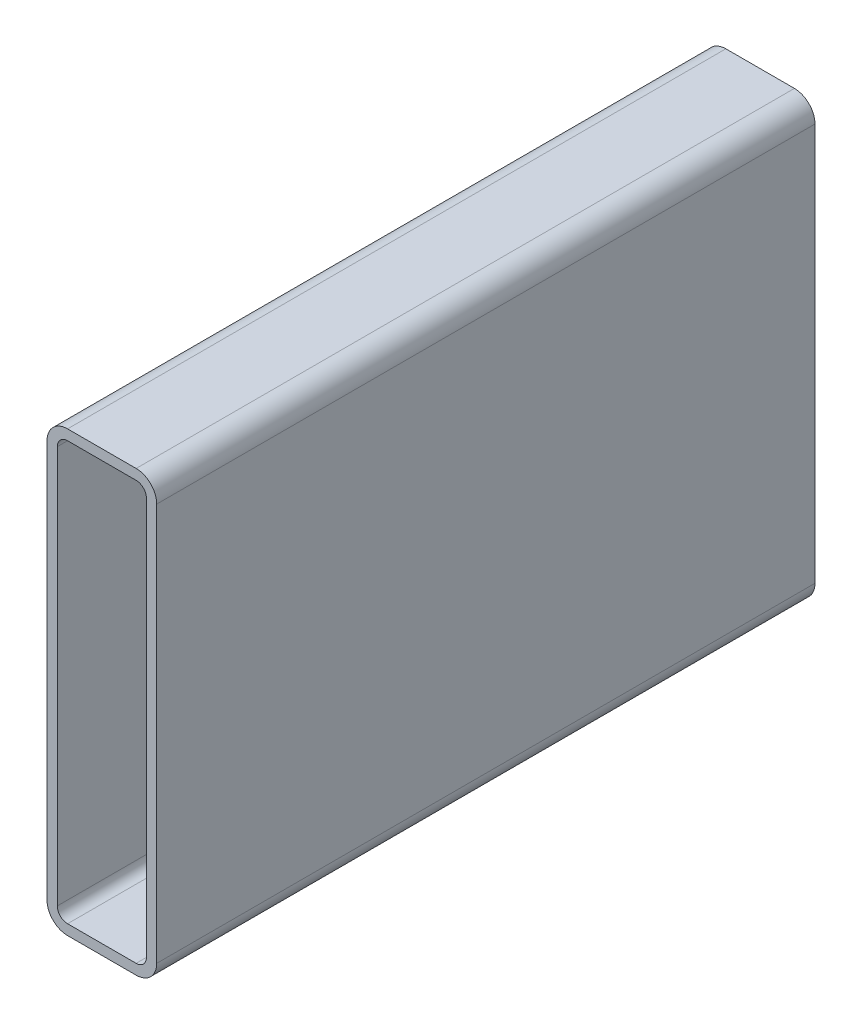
ISO-10303-21;
HEADER;
FILE_DESCRIPTION(('STEP AP214'),'2;1');
FILE_NAME('part.step','',(''),(''),'','','');
FILE_SCHEMA(('AUTOMOTIVE_DESIGN { 1 0 10303 214 1 1 1 1 }'));
ENDSEC;
DATA;
#1=APPLICATION_CONTEXT('core data for automotive mechanical design processes');
#2=APPLICATION_PROTOCOL_DEFINITION('international standard','automotive_design',2000,#1);
#3=PRODUCT_CONTEXT('',#1,'mechanical');
#4=PRODUCT('Part','Part','',(#3));
#5=PRODUCT_RELATED_PRODUCT_CATEGORY('part','',(#4));
#6=PRODUCT_DEFINITION_FORMATION('','',#4);
#7=PRODUCT_DEFINITION_CONTEXT('part definition',#1,'design');
#8=PRODUCT_DEFINITION('design','',#6,#7);
#9=PRODUCT_DEFINITION_SHAPE('','',#8);
#10=(LENGTH_UNIT() NAMED_UNIT(*) SI_UNIT(.MILLI.,.METRE.));
#11=(NAMED_UNIT(*) PLANE_ANGLE_UNIT() SI_UNIT($,.RADIAN.));
#12=(NAMED_UNIT(*) SI_UNIT($,.STERADIAN.) SOLID_ANGLE_UNIT());
#13=UNCERTAINTY_MEASURE_WITH_UNIT(LENGTH_MEASURE(1.E-05),#10,'distance_accuracy_value','');
#14=(GEOMETRIC_REPRESENTATION_CONTEXT(3) GLOBAL_UNCERTAINTY_ASSIGNED_CONTEXT((#13)) GLOBAL_UNIT_ASSIGNED_CONTEXT((#10,
#11,#12)) REPRESENTATION_CONTEXT('',''));
#15=CARTESIAN_POINT('',(0.,0.,0.));
#16=DIRECTION('',(0.,0.,1.));
#17=DIRECTION('',(1.,0.,0.));
#18=AXIS2_PLACEMENT_3D('',#15,#16,#17);
#19=CARTESIAN_POINT('',(9.52500000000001,193.675,304.8));
#20=DIRECTION('',(0.,0.,1.));
#21=DIRECTION('',(1.,0.,0.));
#22=AXIS2_PLACEMENT_3D('',#19,#20,#21);
#23=PLANE('',#22);
#24=CARTESIAN_POINT('',(9.52500000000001,193.675,304.8));
#25=DIRECTION('',(0.,0.,1.));
#26=DIRECTION('',(1.,0.,0.));
#27=AXIS2_PLACEMENT_3D('',#24,#25,#26);
#28=CIRCLE('',#27,9.52500000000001);
#29=CARTESIAN_POINT('',(9.525,203.2,304.8));
#30=VERTEX_POINT('',#29);
#31=CARTESIAN_POINT('',(0.,193.675,304.8));
#32=VERTEX_POINT('',#31);
#33=EDGE_CURVE('E211',#30,#32,#28,.T.);
#34=ORIENTED_EDGE('',*,*,#33,.T.);
#35=DIRECTION('',(0.,-1.,0.));
#36=VECTOR('',#35,1.);
#37=CARTESIAN_POINT('',(0.,9.525,304.8));
#38=LINE('',#37,#36);
#39=CARTESIAN_POINT('',(0.,9.525,304.8));
#40=VERTEX_POINT('',#39);
#41=EDGE_CURVE('E214',#32,#40,#38,.T.);
#42=ORIENTED_EDGE('',*,*,#41,.T.);
#43=CARTESIAN_POINT('',(9.525,9.525,304.8));
#44=DIRECTION('',(0.,0.,1.));
#45=DIRECTION('',(1.,0.,0.));
#46=AXIS2_PLACEMENT_3D('',#43,#44,#45);
#47=CIRCLE('',#46,9.525);
#48=CARTESIAN_POINT('',(9.525,0.,304.8));
#49=VERTEX_POINT('',#48);
#50=EDGE_CURVE('E217',#40,#49,#47,.T.);
#51=ORIENTED_EDGE('',*,*,#50,.T.);
#52=DIRECTION('',(1.,0.,0.));
#53=VECTOR('',#52,1.);
#54=CARTESIAN_POINT('',(41.275,0.,304.8));
#55=LINE('',#54,#53);
#56=CARTESIAN_POINT('',(41.275,0.,304.8));
#57=VERTEX_POINT('',#56);
#58=EDGE_CURVE('E219',#49,#57,#55,.T.);
#59=ORIENTED_EDGE('',*,*,#58,.T.);
#60=CARTESIAN_POINT('',(41.275,9.525,304.8));
#61=DIRECTION('',(0.,0.,1.));
#62=DIRECTION('',(1.,0.,0.));
#63=AXIS2_PLACEMENT_3D('',#60,#61,#62);
#64=CIRCLE('',#63,9.525);
#65=CARTESIAN_POINT('',(50.8,9.525,304.8));
#66=VERTEX_POINT('',#65);
#67=EDGE_CURVE('E221',#57,#66,#64,.T.);
#68=ORIENTED_EDGE('',*,*,#67,.T.);
#69=DIRECTION('',(0.,1.,0.));
#70=VECTOR('',#69,1.);
#71=CARTESIAN_POINT('',(50.8,193.675,304.8));
#72=LINE('',#71,#70);
#73=CARTESIAN_POINT('',(50.8,193.675,304.8));
#74=VERTEX_POINT('',#73);
#75=EDGE_CURVE('E223',#66,#74,#72,.T.);
#76=ORIENTED_EDGE('',*,*,#75,.T.);
#77=CARTESIAN_POINT('',(41.275,193.675,304.8));
#78=DIRECTION('',(0.,0.,1.));
#79=DIRECTION('',(1.,0.,0.));
#80=AXIS2_PLACEMENT_3D('',#77,#78,#79);
#81=CIRCLE('',#80,9.525);
#82=CARTESIAN_POINT('',(41.275,203.2,304.8));
#83=VERTEX_POINT('',#82);
#84=EDGE_CURVE('E225',#74,#83,#81,.T.);
#85=ORIENTED_EDGE('',*,*,#84,.T.);
#86=DIRECTION('',(-1.,0.,0.));
#87=VECTOR('',#86,1.);
#88=CARTESIAN_POINT('',(9.525,203.2,304.8));
#89=LINE('',#88,#87);
#90=EDGE_CURVE('E227',#83,#30,#89,.T.);
#91=ORIENTED_EDGE('',*,*,#90,.T.);
#92=EDGE_LOOP('',(#34,#42,#51,#59,#68,#76,#85,#91));
#93=FACE_BOUND('',#92,.T.);
#94=DIRECTION('',(0.,-1.,0.));
#95=VECTOR('',#94,1.);
#96=CARTESIAN_POINT('',(4.7625,9.525,304.8));
#97=LINE('',#96,#95);
#98=CARTESIAN_POINT('',(4.7625,193.675,304.8));
#99=VERTEX_POINT('',#98);
#100=CARTESIAN_POINT('',(4.7625,9.525,304.8));
#101=VERTEX_POINT('',#100);
#102=EDGE_CURVE('E154',#99,#101,#97,.T.);
#103=ORIENTED_EDGE('',*,*,#102,.F.);
#104=CARTESIAN_POINT('',(9.52500000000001,193.675,304.8));
#105=DIRECTION('',(0.,0.,1.));
#106=DIRECTION('',(1.,0.,0.));
#107=AXIS2_PLACEMENT_3D('',#104,#105,#106);
#108=CIRCLE('',#107,4.7625);
#109=CARTESIAN_POINT('',(9.525,198.4375,304.8));
#110=VERTEX_POINT('',#109);
#111=EDGE_CURVE('E146',#110,#99,#108,.T.);
#112=ORIENTED_EDGE('',*,*,#111,.F.);
#113=DIRECTION('',(-1.,0.,0.));
#114=VECTOR('',#113,1.);
#115=CARTESIAN_POINT('',(9.525,198.4375,304.8));
#116=LINE('',#115,#114);
#117=CARTESIAN_POINT('',(41.275,198.4375,304.8));
#118=VERTEX_POINT('',#117);
#119=EDGE_CURVE('E179',#118,#110,#116,.T.);
#120=ORIENTED_EDGE('',*,*,#119,.F.);
#121=CARTESIAN_POINT('',(41.275,193.675,304.8));
#122=DIRECTION('',(0.,0.,1.));
#123=DIRECTION('',(1.,0.,0.));
#124=AXIS2_PLACEMENT_3D('',#121,#122,#123);
#125=CIRCLE('',#124,4.7625);
#126=CARTESIAN_POINT('',(46.0375,193.675,304.8));
#127=VERTEX_POINT('',#126);
#128=EDGE_CURVE('E177',#127,#118,#125,.T.);
#129=ORIENTED_EDGE('',*,*,#128,.F.);
#130=DIRECTION('',(0.,1.,0.));
#131=VECTOR('',#130,1.);
#132=CARTESIAN_POINT('',(46.0375,193.675,304.8));
#133=LINE('',#132,#131);
#134=CARTESIAN_POINT('',(46.0375,9.525,304.8));
#135=VERTEX_POINT('',#134);
#136=EDGE_CURVE('E175',#135,#127,#133,.T.);
#137=ORIENTED_EDGE('',*,*,#136,.F.);
#138=CARTESIAN_POINT('',(41.275,9.525,304.8));
#139=DIRECTION('',(0.,0.,1.));
#140=DIRECTION('',(1.,0.,0.));
#141=AXIS2_PLACEMENT_3D('',#138,#139,#140);
#142=CIRCLE('',#141,4.7625);
#143=CARTESIAN_POINT('',(41.275,4.7625,304.8));
#144=VERTEX_POINT('',#143);
#145=EDGE_CURVE('E173',#144,#135,#142,.T.);
#146=ORIENTED_EDGE('',*,*,#145,.F.);
#147=DIRECTION('',(1.,0.,0.));
#148=VECTOR('',#147,1.);
#149=CARTESIAN_POINT('',(41.275,4.7625,304.8));
#150=LINE('',#149,#148);
#151=CARTESIAN_POINT('',(9.525,4.7625,304.8));
#152=VERTEX_POINT('',#151);
#153=EDGE_CURVE('E169',#152,#144,#150,.T.);
#154=ORIENTED_EDGE('',*,*,#153,.F.);
#155=CARTESIAN_POINT('',(9.525,9.525,304.8));
#156=DIRECTION('',(0.,0.,1.));
#157=DIRECTION('',(1.,0.,0.));
#158=AXIS2_PLACEMENT_3D('',#155,#156,#157);
#159=CIRCLE('',#158,4.7625);
#160=EDGE_CURVE('E167',#101,#152,#159,.T.);
#161=ORIENTED_EDGE('',*,*,#160,.F.);
#162=EDGE_LOOP('',(#103,#112,#120,#129,#137,#146,#154,#161));
#163=FACE_BOUND('',#162,.T.);
#164=ADVANCED_FACE('F33',(#93,#163),#23,.T.);
#165=CARTESIAN_POINT('',(9.52500000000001,193.675,0.));
#166=DIRECTION('',(0.,0.,1.));
#167=DIRECTION('',(1.,0.,0.));
#168=AXIS2_PLACEMENT_3D('',#165,#166,#167);
#169=PLANE('',#168);
#170=CARTESIAN_POINT('',(9.52500000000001,193.675,0.));
#171=DIRECTION('',(0.,0.,1.));
#172=DIRECTION('',(1.,0.,0.));
#173=AXIS2_PLACEMENT_3D('',#170,#171,#172);
#174=CIRCLE('',#173,9.52500000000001);
#175=CARTESIAN_POINT('',(9.525,203.2,0.));
#176=VERTEX_POINT('',#175);
#177=CARTESIAN_POINT('',(0.,193.675,0.));
#178=VERTEX_POINT('',#177);
#179=EDGE_CURVE('E162',#176,#178,#174,.T.);
#180=ORIENTED_EDGE('',*,*,#179,.F.);
#181=DIRECTION('',(-1.,0.,0.));
#182=VECTOR('',#181,1.);
#183=CARTESIAN_POINT('',(9.525,203.2,0.));
#184=LINE('',#183,#182);
#185=CARTESIAN_POINT('',(41.275,203.2,0.));
#186=VERTEX_POINT('',#185);
#187=EDGE_CURVE('E215',#186,#176,#184,.T.);
#188=ORIENTED_EDGE('',*,*,#187,.F.);
#189=CARTESIAN_POINT('',(41.275,193.675,0.));
#190=DIRECTION('',(0.,0.,1.));
#191=DIRECTION('',(1.,0.,0.));
#192=AXIS2_PLACEMENT_3D('',#189,#190,#191);
#193=CIRCLE('',#192,9.525);
#194=CARTESIAN_POINT('',(50.8,193.675,0.));
#195=VERTEX_POINT('',#194);
#196=EDGE_CURVE('E242',#195,#186,#193,.T.);
#197=ORIENTED_EDGE('',*,*,#196,.F.);
#198=DIRECTION('',(0.,1.,0.));
#199=VECTOR('',#198,1.);
#200=CARTESIAN_POINT('',(50.8,193.675,0.));
#201=LINE('',#200,#199);
#202=CARTESIAN_POINT('',(50.8,9.525,0.));
#203=VERTEX_POINT('',#202);
#204=EDGE_CURVE('E240',#203,#195,#201,.T.);
#205=ORIENTED_EDGE('',*,*,#204,.F.);
#206=CARTESIAN_POINT('',(41.275,9.525,0.));
#207=DIRECTION('',(0.,0.,1.));
#208=DIRECTION('',(1.,0.,0.));
#209=AXIS2_PLACEMENT_3D('',#206,#207,#208);
#210=CIRCLE('',#209,9.525);
#211=CARTESIAN_POINT('',(41.275,0.,0.));
#212=VERTEX_POINT('',#211);
#213=EDGE_CURVE('E238',#212,#203,#210,.T.);
#214=ORIENTED_EDGE('',*,*,#213,.F.);
#215=DIRECTION('',(1.,0.,0.));
#216=VECTOR('',#215,1.);
#217=CARTESIAN_POINT('',(41.275,0.,0.));
#218=LINE('',#217,#216);
#219=CARTESIAN_POINT('',(9.525,0.,0.));
#220=VERTEX_POINT('',#219);
#221=EDGE_CURVE('E236',#220,#212,#218,.T.);
#222=ORIENTED_EDGE('',*,*,#221,.F.);
#223=CARTESIAN_POINT('',(9.525,9.525,0.));
#224=DIRECTION('',(0.,0.,1.));
#225=DIRECTION('',(1.,0.,0.));
#226=AXIS2_PLACEMENT_3D('',#223,#224,#225);
#227=CIRCLE('',#226,9.525);
#228=CARTESIAN_POINT('',(0.,9.525,0.));
#229=VERTEX_POINT('',#228);
#230=EDGE_CURVE('E234',#229,#220,#227,.T.);
#231=ORIENTED_EDGE('',*,*,#230,.F.);
#232=DIRECTION('',(0.,-1.,0.));
#233=VECTOR('',#232,1.);
#234=CARTESIAN_POINT('',(0.,9.525,0.));
#235=LINE('',#234,#233);
#236=EDGE_CURVE('E232',#178,#229,#235,.T.);
#237=ORIENTED_EDGE('',*,*,#236,.F.);
#238=EDGE_LOOP('',(#180,#188,#197,#205,#214,#222,#231,#237));
#239=FACE_BOUND('',#238,.T.);
#240=CARTESIAN_POINT('',(9.52500000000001,193.675,0.));
#241=DIRECTION('',(0.,0.,1.));
#242=DIRECTION('',(1.,0.,0.));
#243=AXIS2_PLACEMENT_3D('',#240,#241,#242);
#244=CIRCLE('',#243,4.7625);
#245=CARTESIAN_POINT('',(9.525,198.4375,0.));
#246=VERTEX_POINT('',#245);
#247=CARTESIAN_POINT('',(4.7625,193.675,0.));
#248=VERTEX_POINT('',#247);
#249=EDGE_CURVE('E56',#246,#248,#244,.T.);
#250=ORIENTED_EDGE('',*,*,#249,.T.);
#251=DIRECTION('',(0.,-1.,0.));
#252=VECTOR('',#251,1.);
#253=CARTESIAN_POINT('',(4.7625,9.525,0.));
#254=LINE('',#253,#252);
#255=CARTESIAN_POINT('',(4.7625,9.525,0.));
#256=VERTEX_POINT('',#255);
#257=EDGE_CURVE('E161',#248,#256,#254,.T.);
#258=ORIENTED_EDGE('',*,*,#257,.T.);
#259=CARTESIAN_POINT('',(9.525,9.525,0.));
#260=DIRECTION('',(0.,0.,1.));
#261=DIRECTION('',(1.,0.,0.));
#262=AXIS2_PLACEMENT_3D('',#259,#260,#261);
#263=CIRCLE('',#262,4.7625);
#264=CARTESIAN_POINT('',(9.525,4.7625,0.));
#265=VERTEX_POINT('',#264);
#266=EDGE_CURVE('E183',#256,#265,#263,.T.);
#267=ORIENTED_EDGE('',*,*,#266,.T.);
#268=DIRECTION('',(1.,0.,0.));
#269=VECTOR('',#268,1.);
#270=CARTESIAN_POINT('',(41.275,4.7625,0.));
#271=LINE('',#270,#269);
#272=CARTESIAN_POINT('',(41.275,4.7625,0.));
#273=VERTEX_POINT('',#272);
#274=EDGE_CURVE('E186',#265,#273,#271,.T.);
#275=ORIENTED_EDGE('',*,*,#274,.T.);
#276=CARTESIAN_POINT('',(41.275,9.525,0.));
#277=DIRECTION('',(0.,0.,1.));
#278=DIRECTION('',(1.,0.,0.));
#279=AXIS2_PLACEMENT_3D('',#276,#277,#278);
#280=CIRCLE('',#279,4.7625);
#281=CARTESIAN_POINT('',(46.0375,9.525,0.));
#282=VERTEX_POINT('',#281);
#283=EDGE_CURVE('E189',#273,#282,#280,.T.);
#284=ORIENTED_EDGE('',*,*,#283,.T.);
#285=DIRECTION('',(0.,1.,0.));
#286=VECTOR('',#285,1.);
#287=CARTESIAN_POINT('',(46.0375,193.675,0.));
#288=LINE('',#287,#286);
#289=CARTESIAN_POINT('',(46.0375,193.675,0.));
#290=VERTEX_POINT('',#289);
#291=EDGE_CURVE('E192',#282,#290,#288,.T.);
#292=ORIENTED_EDGE('',*,*,#291,.T.);
#293=CARTESIAN_POINT('',(41.275,193.675,0.));
#294=DIRECTION('',(0.,0.,1.));
#295=DIRECTION('',(1.,0.,0.));
#296=AXIS2_PLACEMENT_3D('',#293,#294,#295);
#297=CIRCLE('',#296,4.7625);
#298=CARTESIAN_POINT('',(41.275,198.4375,0.));
#299=VERTEX_POINT('',#298);
#300=EDGE_CURVE('E195',#290,#299,#297,.T.);
#301=ORIENTED_EDGE('',*,*,#300,.T.);
#302=DIRECTION('',(-1.,0.,0.));
#303=VECTOR('',#302,1.);
#304=CARTESIAN_POINT('',(9.525,198.4375,0.));
#305=LINE('',#304,#303);
#306=EDGE_CURVE('E155',#299,#246,#305,.T.);
#307=ORIENTED_EDGE('',*,*,#306,.T.);
#308=EDGE_LOOP('',(#250,#258,#267,#275,#284,#292,#301,#307));
#309=FACE_BOUND('',#308,.T.);
#310=ADVANCED_FACE('F272',(#239,#309),#169,.F.);
#311=CARTESIAN_POINT('',(9.52500000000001,193.675,304.8));
#312=DIRECTION('',(0.,0.,-1.));
#313=DIRECTION('',(-1.,0.,0.));
#314=AXIS2_PLACEMENT_3D('',#311,#312,#313);
#315=CYLINDRICAL_SURFACE('',#314,9.52500000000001);
#316=ORIENTED_EDGE('',*,*,#179,.T.);
#317=DIRECTION('',(0.,0.,-1.));
#318=VECTOR('',#317,1.);
#319=CARTESIAN_POINT('',(0.,193.675,304.8));
#320=LINE('',#319,#318);
#321=EDGE_CURVE('E11',#32,#178,#320,.T.);
#322=ORIENTED_EDGE('',*,*,#321,.F.);
#323=ORIENTED_EDGE('',*,*,#33,.F.);
#324=DIRECTION('',(0.,0.,-1.));
#325=VECTOR('',#324,1.);
#326=CARTESIAN_POINT('',(9.525,203.2,304.8));
#327=LINE('',#326,#325);
#328=EDGE_CURVE('E229',#30,#176,#327,.T.);
#329=ORIENTED_EDGE('',*,*,#328,.T.);
#330=EDGE_LOOP('',(#316,#322,#323,#329));
#331=FACE_BOUND('',#330,.T.);
#332=ADVANCED_FACE('F35',(#331),#315,.T.);
#333=CARTESIAN_POINT('',(0.,9.525,304.8));
#334=DIRECTION('',(1.,0.,0.));
#335=DIRECTION('',(0.,0.,-1.));
#336=AXIS2_PLACEMENT_3D('',#333,#334,#335);
#337=PLANE('',#336);
#338=ORIENTED_EDGE('',*,*,#236,.T.);
#339=DIRECTION('',(0.,0.,-1.));
#340=VECTOR('',#339,1.);
#341=CARTESIAN_POINT('',(0.,9.525,304.8));
#342=LINE('',#341,#340);
#343=EDGE_CURVE('E41',#40,#229,#342,.T.);
#344=ORIENTED_EDGE('',*,*,#343,.F.);
#345=ORIENTED_EDGE('',*,*,#41,.F.);
#346=ORIENTED_EDGE('',*,*,#321,.T.);
#347=EDGE_LOOP('',(#338,#344,#345,#346));
#348=FACE_BOUND('',#347,.T.);
#349=ADVANCED_FACE('F289',(#348),#337,.F.);
#350=CARTESIAN_POINT('',(9.525,9.525,304.8));
#351=DIRECTION('',(0.,0.,-1.));
#352=DIRECTION('',(-1.,0.,0.));
#353=AXIS2_PLACEMENT_3D('',#350,#351,#352);
#354=CYLINDRICAL_SURFACE('',#353,9.525);
#355=ORIENTED_EDGE('',*,*,#230,.T.);
#356=DIRECTION('',(0.,0.,-1.));
#357=VECTOR('',#356,1.);
#358=CARTESIAN_POINT('',(9.525,0.,304.8));
#359=LINE('',#358,#357);
#360=EDGE_CURVE('E259',#49,#220,#359,.T.);
#361=ORIENTED_EDGE('',*,*,#360,.F.);
#362=ORIENTED_EDGE('',*,*,#50,.F.);
#363=ORIENTED_EDGE('',*,*,#343,.T.);
#364=EDGE_LOOP('',(#355,#361,#362,#363));
#365=FACE_BOUND('',#364,.T.);
#366=ADVANCED_FACE('F266',(#365),#354,.T.);
#367=CARTESIAN_POINT('',(41.275,0.,304.8));
#368=DIRECTION('',(0.,1.,0.));
#369=DIRECTION('',(0.,0.,1.));
#370=AXIS2_PLACEMENT_3D('',#367,#368,#369);
#371=PLANE('',#370);
#372=ORIENTED_EDGE('',*,*,#221,.T.);
#373=DIRECTION('',(0.,0.,-1.));
#374=VECTOR('',#373,1.);
#375=CARTESIAN_POINT('',(41.275,0.,304.8));
#376=LINE('',#375,#374);
#377=EDGE_CURVE('E256',#57,#212,#376,.T.);
#378=ORIENTED_EDGE('',*,*,#377,.F.);
#379=ORIENTED_EDGE('',*,*,#58,.F.);
#380=ORIENTED_EDGE('',*,*,#360,.T.);
#381=EDGE_LOOP('',(#372,#378,#379,#380));
#382=FACE_BOUND('',#381,.T.);
#383=ADVANCED_FACE('F278',(#382),#371,.F.);
#384=CARTESIAN_POINT('',(41.275,9.525,304.8));
#385=DIRECTION('',(0.,0.,-1.));
#386=DIRECTION('',(-1.,0.,0.));
#387=AXIS2_PLACEMENT_3D('',#384,#385,#386);
#388=CYLINDRICAL_SURFACE('',#387,9.525);
#389=ORIENTED_EDGE('',*,*,#213,.T.);
#390=DIRECTION('',(0.,0.,-1.));
#391=VECTOR('',#390,1.);
#392=CARTESIAN_POINT('',(50.8,9.525,304.8));
#393=LINE('',#392,#391);
#394=EDGE_CURVE('E253',#66,#203,#393,.T.);
#395=ORIENTED_EDGE('',*,*,#394,.F.);
#396=ORIENTED_EDGE('',*,*,#67,.F.);
#397=ORIENTED_EDGE('',*,*,#377,.T.);
#398=EDGE_LOOP('',(#389,#395,#396,#397));
#399=FACE_BOUND('',#398,.T.);
#400=ADVANCED_FACE('F282',(#399),#388,.T.);
#401=CARTESIAN_POINT('',(50.8,193.675,304.8));
#402=DIRECTION('',(-1.,0.,0.));
#403=DIRECTION('',(0.,0.,1.));
#404=AXIS2_PLACEMENT_3D('',#401,#402,#403);
#405=PLANE('',#404);
#406=ORIENTED_EDGE('',*,*,#204,.T.);
#407=DIRECTION('',(0.,0.,-1.));
#408=VECTOR('',#407,1.);
#409=CARTESIAN_POINT('',(50.8,193.675,304.8));
#410=LINE('',#409,#408);
#411=EDGE_CURVE('E250',#74,#195,#410,.T.);
#412=ORIENTED_EDGE('',*,*,#411,.F.);
#413=ORIENTED_EDGE('',*,*,#75,.F.);
#414=ORIENTED_EDGE('',*,*,#394,.T.);
#415=EDGE_LOOP('',(#406,#412,#413,#414));
#416=FACE_BOUND('',#415,.T.);
#417=ADVANCED_FACE('F302',(#416),#405,.F.);
#418=CARTESIAN_POINT('',(41.275,193.675,304.8));
#419=DIRECTION('',(0.,0.,-1.));
#420=DIRECTION('',(-1.,0.,0.));
#421=AXIS2_PLACEMENT_3D('',#418,#419,#420);
#422=CYLINDRICAL_SURFACE('',#421,9.525);
#423=ORIENTED_EDGE('',*,*,#196,.T.);
#424=DIRECTION('',(0.,0.,-1.));
#425=VECTOR('',#424,1.);
#426=CARTESIAN_POINT('',(41.275,203.2,304.8));
#427=LINE('',#426,#425);
#428=EDGE_CURVE('E247',#83,#186,#427,.T.);
#429=ORIENTED_EDGE('',*,*,#428,.F.);
#430=ORIENTED_EDGE('',*,*,#84,.F.);
#431=ORIENTED_EDGE('',*,*,#411,.T.);
#432=EDGE_LOOP('',(#423,#429,#430,#431));
#433=FACE_BOUND('',#432,.T.);
#434=ADVANCED_FACE('F300',(#433),#422,.T.);
#435=CARTESIAN_POINT('',(9.525,203.2,304.8));
#436=DIRECTION('',(0.,-1.,0.));
#437=DIRECTION('',(0.,0.,-1.));
#438=AXIS2_PLACEMENT_3D('',#435,#436,#437);
#439=PLANE('',#438);
#440=ORIENTED_EDGE('',*,*,#187,.T.);
#441=ORIENTED_EDGE('',*,*,#328,.F.);
#442=ORIENTED_EDGE('',*,*,#90,.F.);
#443=ORIENTED_EDGE('',*,*,#428,.T.);
#444=EDGE_LOOP('',(#440,#441,#442,#443));
#445=FACE_BOUND('',#444,.T.);
#446=ADVANCED_FACE('F295',(#445),#439,.F.);
#447=CARTESIAN_POINT('',(9.52500000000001,193.675,304.8));
#448=DIRECTION('',(0.,0.,-1.));
#449=DIRECTION('',(-1.,0.,0.));
#450=AXIS2_PLACEMENT_3D('',#447,#448,#449);
#451=CYLINDRICAL_SURFACE('',#450,4.7625);
#452=ORIENTED_EDGE('',*,*,#249,.F.);
#453=DIRECTION('',(0.,0.,-1.));
#454=VECTOR('',#453,1.);
#455=CARTESIAN_POINT('',(9.525,198.4375,304.8));
#456=LINE('',#455,#454);
#457=EDGE_CURVE('E150',#110,#246,#456,.T.);
#458=ORIENTED_EDGE('',*,*,#457,.F.);
#459=ORIENTED_EDGE('',*,*,#111,.T.);
#460=DIRECTION('',(0.,0.,-1.));
#461=VECTOR('',#460,1.);
#462=CARTESIAN_POINT('',(4.7625,193.675,304.8));
#463=LINE('',#462,#461);
#464=EDGE_CURVE('E149',#99,#248,#463,.T.);
#465=ORIENTED_EDGE('',*,*,#464,.T.);
#466=EDGE_LOOP('',(#452,#458,#459,#465));
#467=FACE_BOUND('',#466,.T.);
#468=ADVANCED_FACE('F148',(#467),#451,.F.);
#469=CARTESIAN_POINT('',(4.7625,9.525,304.8));
#470=DIRECTION('',(1.,0.,0.));
#471=DIRECTION('',(0.,0.,-1.));
#472=AXIS2_PLACEMENT_3D('',#469,#470,#471);
#473=PLANE('',#472);
#474=ORIENTED_EDGE('',*,*,#257,.F.);
#475=ORIENTED_EDGE('',*,*,#464,.F.);
#476=ORIENTED_EDGE('',*,*,#102,.T.);
#477=DIRECTION('',(0.,0.,-1.));
#478=VECTOR('',#477,1.);
#479=CARTESIAN_POINT('',(4.7625,9.525,304.8));
#480=LINE('',#479,#478);
#481=EDGE_CURVE('E163',#101,#256,#480,.T.);
#482=ORIENTED_EDGE('',*,*,#481,.T.);
#483=EDGE_LOOP('',(#474,#475,#476,#482));
#484=FACE_BOUND('',#483,.T.);
#485=ADVANCED_FACE('F158',(#484),#473,.T.);
#486=CARTESIAN_POINT('',(9.525,9.525,304.8));
#487=DIRECTION('',(0.,0.,-1.));
#488=DIRECTION('',(-1.,0.,0.));
#489=AXIS2_PLACEMENT_3D('',#486,#487,#488);
#490=CYLINDRICAL_SURFACE('',#489,4.7625);
#491=ORIENTED_EDGE('',*,*,#266,.F.);
#492=ORIENTED_EDGE('',*,*,#481,.F.);
#493=ORIENTED_EDGE('',*,*,#160,.T.);
#494=DIRECTION('',(0.,0.,-1.));
#495=VECTOR('',#494,1.);
#496=CARTESIAN_POINT('',(9.525,4.7625,304.8));
#497=LINE('',#496,#495);
#498=EDGE_CURVE('E208',#152,#265,#497,.T.);
#499=ORIENTED_EDGE('',*,*,#498,.T.);
#500=EDGE_LOOP('',(#491,#492,#493,#499));
#501=FACE_BOUND('',#500,.T.);
#502=ADVANCED_FACE('F327',(#501),#490,.F.);
#503=CARTESIAN_POINT('',(41.275,4.7625,304.8));
#504=DIRECTION('',(0.,1.,0.));
#505=DIRECTION('',(0.,0.,1.));
#506=AXIS2_PLACEMENT_3D('',#503,#504,#505);
#507=PLANE('',#506);
#508=ORIENTED_EDGE('',*,*,#274,.F.);
#509=ORIENTED_EDGE('',*,*,#498,.F.);
#510=ORIENTED_EDGE('',*,*,#153,.T.);
#511=DIRECTION('',(0.,0.,-1.));
#512=VECTOR('',#511,1.);
#513=CARTESIAN_POINT('',(41.275,4.7625,304.8));
#514=LINE('',#513,#512);
#515=EDGE_CURVE('E206',#144,#273,#514,.T.);
#516=ORIENTED_EDGE('',*,*,#515,.T.);
#517=EDGE_LOOP('',(#508,#509,#510,#516));
#518=FACE_BOUND('',#517,.T.);
#519=ADVANCED_FACE('F331',(#518),#507,.T.);
#520=CARTESIAN_POINT('',(41.275,9.525,304.8));
#521=DIRECTION('',(0.,0.,-1.));
#522=DIRECTION('',(-1.,0.,0.));
#523=AXIS2_PLACEMENT_3D('',#520,#521,#522);
#524=CYLINDRICAL_SURFACE('',#523,4.7625);
#525=ORIENTED_EDGE('',*,*,#283,.F.);
#526=ORIENTED_EDGE('',*,*,#515,.F.);
#527=ORIENTED_EDGE('',*,*,#145,.T.);
#528=DIRECTION('',(0.,0.,-1.));
#529=VECTOR('',#528,1.);
#530=CARTESIAN_POINT('',(46.0375,9.525,304.8));
#531=LINE('',#530,#529);
#532=EDGE_CURVE('E204',#135,#282,#531,.T.);
#533=ORIENTED_EDGE('',*,*,#532,.T.);
#534=EDGE_LOOP('',(#525,#526,#527,#533));
#535=FACE_BOUND('',#534,.T.);
#536=ADVANCED_FACE('F337',(#535),#524,.F.);
#537=CARTESIAN_POINT('',(46.0375,193.675,304.8));
#538=DIRECTION('',(-1.,0.,0.));
#539=DIRECTION('',(0.,0.,1.));
#540=AXIS2_PLACEMENT_3D('',#537,#538,#539);
#541=PLANE('',#540);
#542=ORIENTED_EDGE('',*,*,#291,.F.);
#543=ORIENTED_EDGE('',*,*,#532,.F.);
#544=ORIENTED_EDGE('',*,*,#136,.T.);
#545=DIRECTION('',(0.,0.,-1.));
#546=VECTOR('',#545,1.);
#547=CARTESIAN_POINT('',(46.0375,193.675,304.8));
#548=LINE('',#547,#546);
#549=EDGE_CURVE('E202',#127,#290,#548,.T.);
#550=ORIENTED_EDGE('',*,*,#549,.T.);
#551=EDGE_LOOP('',(#542,#543,#544,#550));
#552=FACE_BOUND('',#551,.T.);
#553=ADVANCED_FACE('F341',(#552),#541,.T.);
#554=CARTESIAN_POINT('',(41.275,193.675,304.8));
#555=DIRECTION('',(0.,0.,-1.));
#556=DIRECTION('',(-1.,0.,0.));
#557=AXIS2_PLACEMENT_3D('',#554,#555,#556);
#558=CYLINDRICAL_SURFACE('',#557,4.7625);
#559=ORIENTED_EDGE('',*,*,#300,.F.);
#560=ORIENTED_EDGE('',*,*,#549,.F.);
#561=ORIENTED_EDGE('',*,*,#128,.T.);
#562=DIRECTION('',(0.,0.,-1.));
#563=VECTOR('',#562,1.);
#564=CARTESIAN_POINT('',(41.275,198.4375,304.8));
#565=LINE('',#564,#563);
#566=EDGE_CURVE('E48',#118,#299,#565,.T.);
#567=ORIENTED_EDGE('',*,*,#566,.T.);
#568=EDGE_LOOP('',(#559,#560,#561,#567));
#569=FACE_BOUND('',#568,.T.);
#570=ADVANCED_FACE('F345',(#569),#558,.F.);
#571=CARTESIAN_POINT('',(9.525,198.4375,304.8));
#572=DIRECTION('',(0.,-1.,0.));
#573=DIRECTION('',(0.,0.,-1.));
#574=AXIS2_PLACEMENT_3D('',#571,#572,#573);
#575=PLANE('',#574);
#576=ORIENTED_EDGE('',*,*,#306,.F.);
#577=ORIENTED_EDGE('',*,*,#566,.F.);
#578=ORIENTED_EDGE('',*,*,#119,.T.);
#579=ORIENTED_EDGE('',*,*,#457,.T.);
#580=EDGE_LOOP('',(#576,#577,#578,#579));
#581=FACE_BOUND('',#580,.T.);
#582=ADVANCED_FACE('F349',(#581),#575,.T.);
#583=CLOSED_SHELL('',(#164,#310,#332,#349,#366,#383,#400,#417,#434,#446,#468,#485,#502,#519,
#536,#553,#570,#582));
#584=MANIFOLD_SOLID_BREP('B2',#583);
#585=ADVANCED_BREP_SHAPE_REPRESENTATION('',(#18,#584),#14);
#586=SHAPE_DEFINITION_REPRESENTATION(#9,#585);
ENDSEC;
END-ISO-10303-21;
